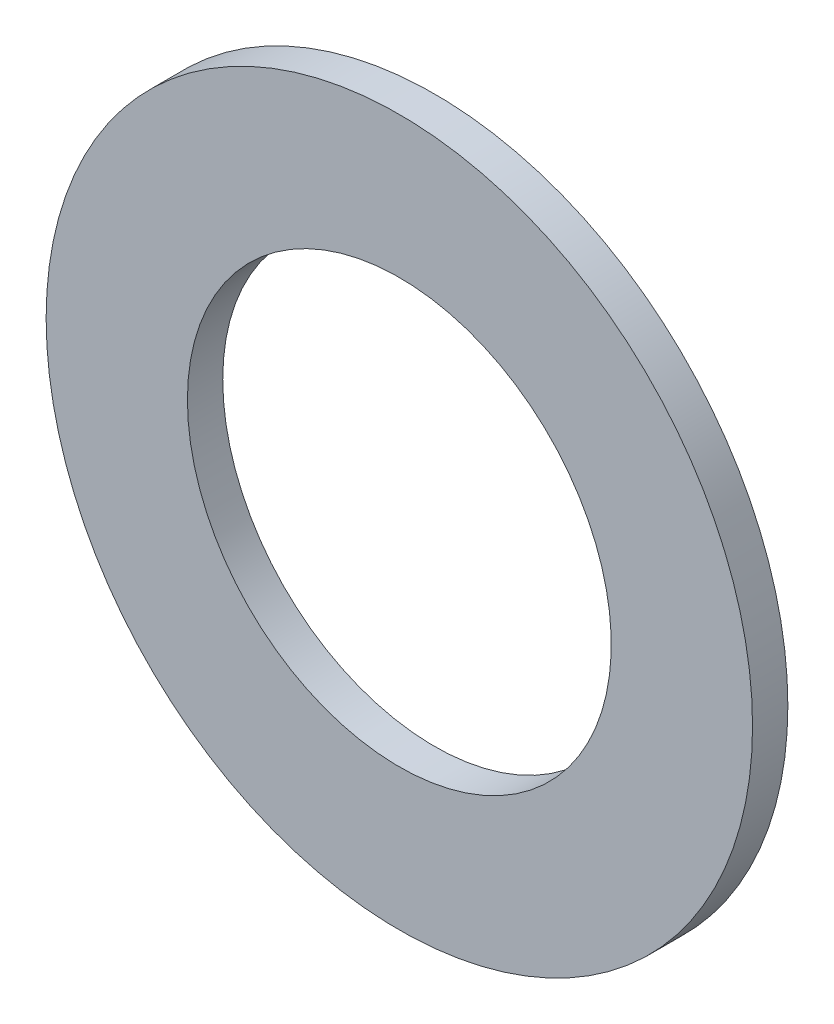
from build123d import *

# Parameters (mm, degrees)
SKETCH1_R          = 2.5
SKETCH1_R_2        = 1.5
BASE_EXTRUDE_DEPTH = 0.25


with BuildPart() as part:
    # Sketch1 → Base-Extrude (new body)
    with BuildSketch(Plane.XY):
        Circle(SKETCH1_R)
        Circle(SKETCH1_R_2, mode=Mode.SUBTRACT)
    extrude(amount=BASE_EXTRUDE_DEPTH)


solid = part.part
